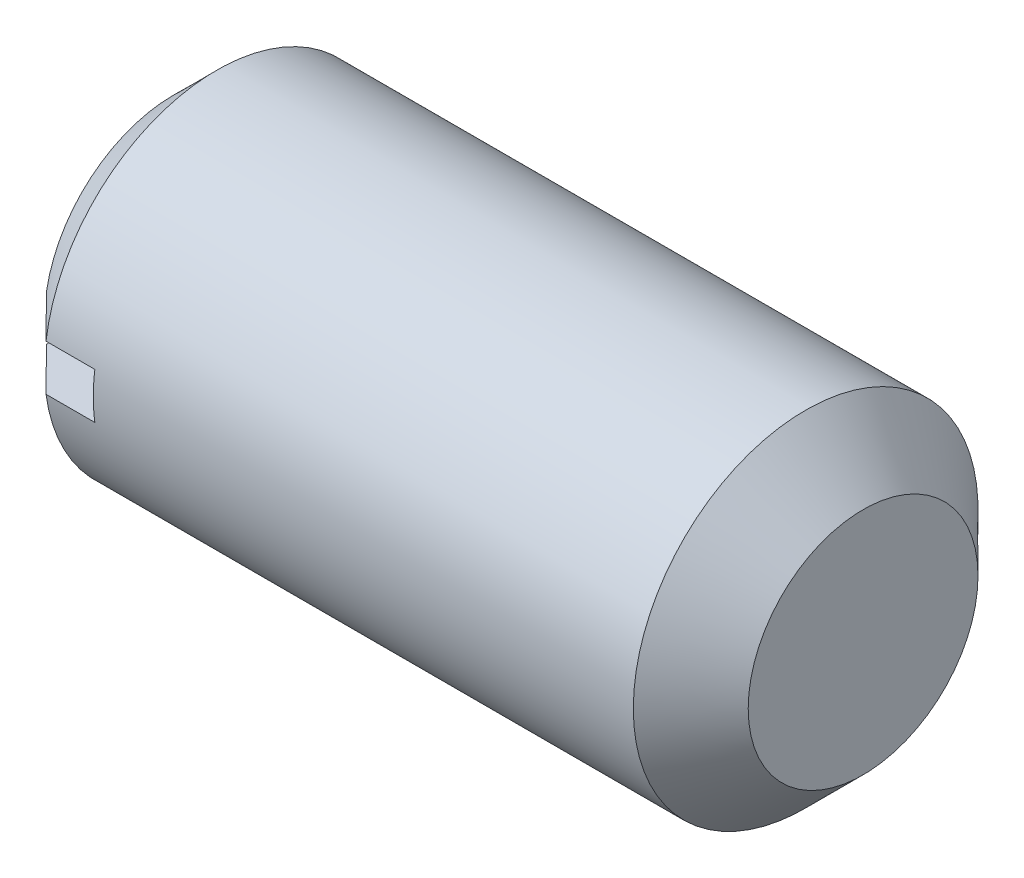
from build123d import *

# Parameters (mm, degrees)
NOTCH_DEPTH      = 7.363961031
NOTCH_DEPTH_BACK = 7.363961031
SKETCH2_W        = 0.8
SKETCH2_H        = 0.4


with BuildPart() as part:
    # Sketch1 → Base (revolve)
    with BuildSketch(Plane.XY, mode=Mode.PRIVATE) as base_sk:
        Polygon((0, 0), (6, 0), (6, 1), (5.5, 1.5), (0.375, 1.5), (0, 1.125), align=None)
    revolve(base_sk.sketch.rotate(Axis((-10.745014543, 0, 0), (1, 0, 0)), 90), axis=Axis((-10.745014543, 0, 0), (1, 0, 0)))

    # Sketch2 → Notch (cut, two sides: drawn at the far end of the back side and taken through both)
    with BuildSketch(Plane.XY.offset(-NOTCH_DEPTH_BACK)):
        with Locations((0.4, 0)):
            Rectangle(SKETCH2_W, SKETCH2_H)
    extrude(amount=NOTCH_DEPTH + NOTCH_DEPTH_BACK, mode=Mode.SUBTRACT)


solid = part.part
